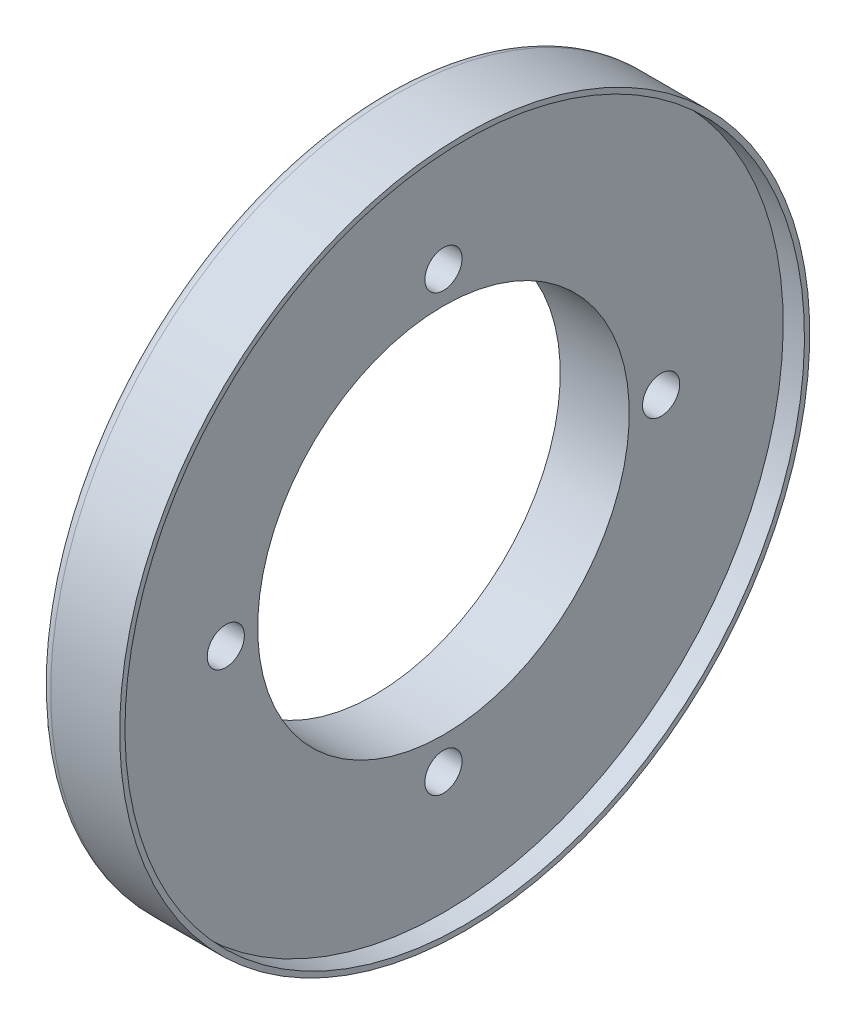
ISO-10303-21;
HEADER;
FILE_DESCRIPTION(('STEP AP214'),'2;1');
FILE_NAME('part.step','',(''),(''),'','','');
FILE_SCHEMA(('AUTOMOTIVE_DESIGN { 1 0 10303 214 1 1 1 1 }'));
ENDSEC;
DATA;
#1=APPLICATION_CONTEXT('core data for automotive mechanical design processes');
#2=APPLICATION_PROTOCOL_DEFINITION('international standard','automotive_design',2000,#1);
#3=PRODUCT_CONTEXT('',#1,'mechanical');
#4=PRODUCT('Part','Part','',(#3));
#5=PRODUCT_RELATED_PRODUCT_CATEGORY('part','',(#4));
#6=PRODUCT_DEFINITION_FORMATION('','',#4);
#7=PRODUCT_DEFINITION_CONTEXT('part definition',#1,'design');
#8=PRODUCT_DEFINITION('design','',#6,#7);
#9=PRODUCT_DEFINITION_SHAPE('','',#8);
#10=(LENGTH_UNIT() NAMED_UNIT(*) SI_UNIT(.MILLI.,.METRE.));
#11=(NAMED_UNIT(*) PLANE_ANGLE_UNIT() SI_UNIT($,.RADIAN.));
#12=(NAMED_UNIT(*) SI_UNIT($,.STERADIAN.) SOLID_ANGLE_UNIT());
#13=UNCERTAINTY_MEASURE_WITH_UNIT(LENGTH_MEASURE(1.E-05),#10,'distance_accuracy_value','');
#14=(GEOMETRIC_REPRESENTATION_CONTEXT(3) GLOBAL_UNCERTAINTY_ASSIGNED_CONTEXT((#13)) GLOBAL_UNIT_ASSIGNED_CONTEXT((#10,
#11,#12)) REPRESENTATION_CONTEXT('',''));
#15=CARTESIAN_POINT('',(0.,0.,0.));
#16=DIRECTION('',(0.,0.,1.));
#17=DIRECTION('',(1.,0.,0.));
#18=AXIS2_PLACEMENT_3D('',#15,#16,#17);
#19=CARTESIAN_POINT('',(-23.9525272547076,0.,0.));
#20=DIRECTION('',(-1.,0.,0.));
#21=DIRECTION('',(0.,-1.,0.));
#22=AXIS2_PLACEMENT_3D('',#19,#20,#21);
#23=CYLINDRICAL_SURFACE('',#22,47.);
#24=CARTESIAN_POINT('',(0.,0.,0.));
#25=DIRECTION('',(-1.,0.,0.));
#26=DIRECTION('',(0.,-1.,0.));
#27=AXIS2_PLACEMENT_3D('',#24,#25,#26);
#28=CIRCLE('',#27,47.);
#29=CARTESIAN_POINT('',(0.,-47.,0.));
#30=VERTEX_POINT('',#29);
#31=EDGE_CURVE('E62',#30,#30,#28,.T.);
#32=ORIENTED_EDGE('',*,*,#31,.F.);
#33=EDGE_LOOP('',(#32));
#34=FACE_BOUND('',#33,.T.);
#35=CARTESIAN_POINT('',(2.,0.,0.));
#36=DIRECTION('',(-1.,0.,0.));
#37=DIRECTION('',(0.,-1.,0.));
#38=AXIS2_PLACEMENT_3D('',#35,#36,#37);
#39=CIRCLE('',#38,47.);
#40=CARTESIAN_POINT('',(2.,-47.,0.));
#41=VERTEX_POINT('',#40);
#42=EDGE_CURVE('E10',#41,#41,#39,.T.);
#43=ORIENTED_EDGE('',*,*,#42,.T.);
#44=EDGE_LOOP('',(#43));
#45=FACE_BOUND('',#44,.T.);
#46=ADVANCED_FACE('F31',(#34,#45),#23,.T.);
#47=CARTESIAN_POINT('',(2.,47.,0.));
#48=DIRECTION('',(1.,0.,0.));
#49=DIRECTION('',(0.,1.,0.));
#50=AXIS2_PLACEMENT_3D('',#47,#48,#49);
#51=PLANE('',#50);
#52=ORIENTED_EDGE('',*,*,#42,.F.);
#53=EDGE_LOOP('',(#52));
#54=FACE_BOUND('',#53,.T.);
#55=CARTESIAN_POINT('',(2.,0.,0.));
#56=DIRECTION('',(-1.,0.,0.));
#57=DIRECTION('',(0.,-1.,0.));
#58=AXIS2_PLACEMENT_3D('',#55,#56,#57);
#59=CIRCLE('',#58,63.);
#60=CARTESIAN_POINT('',(2.,-63.,0.));
#61=VERTEX_POINT('',#60);
#62=EDGE_CURVE('E37',#61,#61,#59,.T.);
#63=ORIENTED_EDGE('',*,*,#62,.T.);
#64=EDGE_LOOP('',(#63));
#65=FACE_BOUND('',#64,.T.);
#66=ADVANCED_FACE('F128',(#54,#65),#51,.F.);
#67=CARTESIAN_POINT('',(4.,0.,0.));
#68=DIRECTION('',(-1.,0.,0.));
#69=DIRECTION('',(0.,-1.,0.));
#70=AXIS2_PLACEMENT_3D('',#67,#68,#69);
#71=TOROIDAL_SURFACE('',#70,63.,2.);
#72=ORIENTED_EDGE('',*,*,#62,.F.);
#73=EDGE_LOOP('',(#72));
#74=FACE_BOUND('',#73,.T.);
#75=CARTESIAN_POINT('',(4.,0.,0.));
#76=DIRECTION('',(-1.,0.,0.));
#77=DIRECTION('',(0.,-1.,0.));
#78=AXIS2_PLACEMENT_3D('',#75,#76,#77);
#79=CIRCLE('',#78,65.);
#80=CARTESIAN_POINT('',(4.,-65.,0.));
#81=VERTEX_POINT('',#80);
#82=EDGE_CURVE('E41',#81,#81,#79,.T.);
#83=ORIENTED_EDGE('',*,*,#82,.T.);
#84=EDGE_LOOP('',(#83));
#85=FACE_BOUND('',#84,.T.);
#86=ADVANCED_FACE('F132',(#74,#85),#71,.T.);
#87=CARTESIAN_POINT('',(-23.9525272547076,0.,0.));
#88=DIRECTION('',(-1.,0.,0.));
#89=DIRECTION('',(0.,-1.,0.));
#90=AXIS2_PLACEMENT_3D('',#87,#88,#89);
#91=CYLINDRICAL_SURFACE('',#90,65.);
#92=ORIENTED_EDGE('',*,*,#82,.F.);
#93=EDGE_LOOP('',(#92));
#94=FACE_BOUND('',#93,.T.);
#95=CARTESIAN_POINT('',(17.,0.,0.));
#96=DIRECTION('',(-1.,0.,0.));
#97=DIRECTION('',(0.,-1.,0.));
#98=AXIS2_PLACEMENT_3D('',#95,#96,#97);
#99=CIRCLE('',#98,65.);
#100=CARTESIAN_POINT('',(17.,-65.,0.));
#101=VERTEX_POINT('',#100);
#102=EDGE_CURVE('E45',#101,#101,#99,.T.);
#103=ORIENTED_EDGE('',*,*,#102,.T.);
#104=EDGE_LOOP('',(#103));
#105=FACE_BOUND('',#104,.T.);
#106=ADVANCED_FACE('F137',(#94,#105),#91,.T.);
#107=CARTESIAN_POINT('',(17.,65.,0.));
#108=DIRECTION('',(-1.,0.,0.));
#109=DIRECTION('',(0.,-1.,0.));
#110=AXIS2_PLACEMENT_3D('',#107,#108,#109);
#111=PLANE('',#110);
#112=ORIENTED_EDGE('',*,*,#102,.F.);
#113=EDGE_LOOP('',(#112));
#114=FACE_BOUND('',#113,.T.);
#115=CARTESIAN_POINT('',(17.,0.,0.));
#116=DIRECTION('',(-1.,0.,0.));
#117=DIRECTION('',(0.,-1.,0.));
#118=AXIS2_PLACEMENT_3D('',#115,#116,#117);
#119=CIRCLE('',#118,64.);
#120=CARTESIAN_POINT('',(17.,-64.,0.));
#121=VERTEX_POINT('',#120);
#122=EDGE_CURVE('E50',#121,#121,#119,.T.);
#123=ORIENTED_EDGE('',*,*,#122,.T.);
#124=EDGE_LOOP('',(#123));
#125=FACE_BOUND('',#124,.T.);
#126=ADVANCED_FACE('F143',(#114,#125),#111,.F.);
#127=CARTESIAN_POINT('',(-23.9525272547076,0.,0.));
#128=DIRECTION('',(-1.,0.,0.));
#129=DIRECTION('',(0.,-1.,0.));
#130=AXIS2_PLACEMENT_3D('',#127,#128,#129);
#131=CYLINDRICAL_SURFACE('',#130,64.);
#132=ORIENTED_EDGE('',*,*,#122,.F.);
#133=EDGE_LOOP('',(#132));
#134=FACE_BOUND('',#133,.T.);
#135=CARTESIAN_POINT('',(13.,0.,0.));
#136=DIRECTION('',(-1.,0.,0.));
#137=DIRECTION('',(0.,-1.,0.));
#138=AXIS2_PLACEMENT_3D('',#135,#136,#137);
#139=CIRCLE('',#138,64.);
#140=CARTESIAN_POINT('',(13.,-64.,0.));
#141=VERTEX_POINT('',#140);
#142=EDGE_CURVE('E53',#141,#141,#139,.T.);
#143=ORIENTED_EDGE('',*,*,#142,.T.);
#144=EDGE_LOOP('',(#143));
#145=FACE_BOUND('',#144,.T.);
#146=ADVANCED_FACE('F104',(#134,#145),#131,.F.);
#147=CARTESIAN_POINT('',(13.,64.,0.));
#148=DIRECTION('',(-1.,0.,0.));
#149=DIRECTION('',(0.,-1.,0.));
#150=AXIS2_PLACEMENT_3D('',#147,#148,#149);
#151=PLANE('',#150);
#152=CARTESIAN_POINT('',(13.,41.,-4.29452453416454E-13));
#153=DIRECTION('',(1.,0.,0.));
#154=DIRECTION('',(0.,1.,0.));
#155=AXIS2_PLACEMENT_3D('',#152,#153,#154);
#156=CIRCLE('',#155,3.5);
#157=CARTESIAN_POINT('',(13.,44.5,-4.29452453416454E-13));
#158=VERTEX_POINT('',#157);
#159=EDGE_CURVE('E84',#158,#158,#156,.T.);
#160=ORIENTED_EDGE('',*,*,#159,.F.);
#161=EDGE_LOOP('',(#160));
#162=FACE_BOUND('',#161,.T.);
#163=CARTESIAN_POINT('',(13.,-1.43252208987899E-13,41.));
#164=DIRECTION('',(1.,0.,0.));
#165=DIRECTION('',(0.,1.,0.));
#166=AXIS2_PLACEMENT_3D('',#163,#164,#165);
#167=CIRCLE('',#166,3.49999999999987);
#168=CARTESIAN_POINT('',(13.,3.49999999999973,41.));
#169=VERTEX_POINT('',#168);
#170=EDGE_CURVE('E78',#169,#169,#167,.T.);
#171=ORIENTED_EDGE('',*,*,#170,.F.);
#172=EDGE_LOOP('',(#171));
#173=FACE_BOUND('',#172,.T.);
#174=CARTESIAN_POINT('',(13.,-41.0000000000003,0.));
#175=DIRECTION('',(1.,0.,0.));
#176=DIRECTION('',(0.,1.,0.));
#177=AXIS2_PLACEMENT_3D('',#174,#175,#176);
#178=CIRCLE('',#177,3.49999999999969);
#179=CARTESIAN_POINT('',(13.,-37.5000000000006,0.));
#180=VERTEX_POINT('',#179);
#181=EDGE_CURVE('E72',#180,#180,#178,.T.);
#182=ORIENTED_EDGE('',*,*,#181,.F.);
#183=EDGE_LOOP('',(#182));
#184=FACE_BOUND('',#183,.T.);
#185=CARTESIAN_POINT('',(13.,-1.43252208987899E-13,-41.));
#186=DIRECTION('',(1.,0.,0.));
#187=DIRECTION('',(0.,1.,0.));
#188=AXIS2_PLACEMENT_3D('',#185,#186,#187);
#189=CIRCLE('',#188,3.50000000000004);
#190=CARTESIAN_POINT('',(13.,3.4999999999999,-41.));
#191=VERTEX_POINT('',#190);
#192=EDGE_CURVE('E66',#191,#191,#189,.T.);
#193=ORIENTED_EDGE('',*,*,#192,.F.);
#194=EDGE_LOOP('',(#193));
#195=FACE_BOUND('',#194,.T.);
#196=ORIENTED_EDGE('',*,*,#142,.F.);
#197=EDGE_LOOP('',(#196));
#198=FACE_BOUND('',#197,.T.);
#199=CARTESIAN_POINT('',(13.,0.,0.));
#200=DIRECTION('',(-1.,0.,0.));
#201=DIRECTION('',(0.,-1.,0.));
#202=AXIS2_PLACEMENT_3D('',#199,#200,#201);
#203=CIRCLE('',#202,35.);
#204=CARTESIAN_POINT('',(13.,-35.,0.));
#205=VERTEX_POINT('',#204);
#206=EDGE_CURVE('E56',#205,#205,#203,.T.);
#207=ORIENTED_EDGE('',*,*,#206,.T.);
#208=EDGE_LOOP('',(#207));
#209=FACE_BOUND('',#208,.T.);
#210=ADVANCED_FACE('F100',(#162,#173,#184,#195,#198,#209),#151,.F.);
#211=CARTESIAN_POINT('',(-23.9525272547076,0.,0.));
#212=DIRECTION('',(-1.,0.,0.));
#213=DIRECTION('',(0.,-1.,0.));
#214=AXIS2_PLACEMENT_3D('',#211,#212,#213);
#215=CYLINDRICAL_SURFACE('',#214,35.);
#216=ORIENTED_EDGE('',*,*,#206,.F.);
#217=EDGE_LOOP('',(#216));
#218=FACE_BOUND('',#217,.T.);
#219=CARTESIAN_POINT('',(0.,0.,0.));
#220=DIRECTION('',(-1.,0.,0.));
#221=DIRECTION('',(0.,-1.,0.));
#222=AXIS2_PLACEMENT_3D('',#219,#220,#221);
#223=CIRCLE('',#222,35.);
#224=CARTESIAN_POINT('',(0.,-35.,0.));
#225=VERTEX_POINT('',#224);
#226=EDGE_CURVE('E59',#225,#225,#223,.T.);
#227=ORIENTED_EDGE('',*,*,#226,.T.);
#228=EDGE_LOOP('',(#227));
#229=FACE_BOUND('',#228,.T.);
#230=ADVANCED_FACE('F103',(#218,#229),#215,.F.);
#231=CARTESIAN_POINT('',(0.,35.,0.));
#232=DIRECTION('',(1.,0.,0.));
#233=DIRECTION('',(0.,1.,0.));
#234=AXIS2_PLACEMENT_3D('',#231,#232,#233);
#235=PLANE('',#234);
#236=CARTESIAN_POINT('',(0.,41.,-4.29452453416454E-13));
#237=DIRECTION('',(1.,0.,0.));
#238=DIRECTION('',(0.,1.,0.));
#239=AXIS2_PLACEMENT_3D('',#236,#237,#238);
#240=CIRCLE('',#239,3.5);
#241=CARTESIAN_POINT('',(0.,44.5,-4.29452453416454E-13));
#242=VERTEX_POINT('',#241);
#243=EDGE_CURVE('E81',#242,#242,#240,.T.);
#244=ORIENTED_EDGE('',*,*,#243,.T.);
#245=EDGE_LOOP('',(#244));
#246=FACE_BOUND('',#245,.T.);
#247=CARTESIAN_POINT('',(0.,-1.43079881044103E-13,41.));
#248=DIRECTION('',(1.,0.,0.));
#249=DIRECTION('',(0.,1.,0.));
#250=AXIS2_PLACEMENT_3D('',#247,#248,#249);
#251=CIRCLE('',#250,3.49999999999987);
#252=CARTESIAN_POINT('',(0.,3.49999999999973,41.));
#253=VERTEX_POINT('',#252);
#254=EDGE_CURVE('E75',#253,#253,#251,.T.);
#255=ORIENTED_EDGE('',*,*,#254,.T.);
#256=EDGE_LOOP('',(#255));
#257=FACE_BOUND('',#256,.T.);
#258=CARTESIAN_POINT('',(0.,-41.0000000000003,0.));
#259=DIRECTION('',(1.,0.,0.));
#260=DIRECTION('',(0.,1.,0.));
#261=AXIS2_PLACEMENT_3D('',#258,#259,#260);
#262=CIRCLE('',#261,3.49999999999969);
#263=CARTESIAN_POINT('',(0.,-37.5000000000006,0.));
#264=VERTEX_POINT('',#263);
#265=EDGE_CURVE('E69',#264,#264,#262,.T.);
#266=ORIENTED_EDGE('',*,*,#265,.T.);
#267=EDGE_LOOP('',(#266));
#268=FACE_BOUND('',#267,.T.);
#269=CARTESIAN_POINT('',(0.,-1.43079881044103E-13,-41.));
#270=DIRECTION('',(1.,0.,0.));
#271=DIRECTION('',(0.,1.,0.));
#272=AXIS2_PLACEMENT_3D('',#269,#270,#271);
#273=CIRCLE('',#272,3.50000000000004);
#274=CARTESIAN_POINT('',(0.,3.4999999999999,-41.));
#275=VERTEX_POINT('',#274);
#276=EDGE_CURVE('E65',#275,#275,#273,.T.);
#277=ORIENTED_EDGE('',*,*,#276,.T.);
#278=EDGE_LOOP('',(#277));
#279=FACE_BOUND('',#278,.T.);
#280=ORIENTED_EDGE('',*,*,#226,.F.);
#281=EDGE_LOOP('',(#280));
#282=FACE_BOUND('',#281,.T.);
#283=ORIENTED_EDGE('',*,*,#31,.T.);
#284=EDGE_LOOP('',(#283));
#285=FACE_BOUND('',#284,.T.);
#286=ADVANCED_FACE('F90',(#246,#257,#268,#279,#282,#285),#235,.F.);
#287=CARTESIAN_POINT('',(0.,-1.43079881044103E-13,-41.));
#288=DIRECTION('',(1.,0.,0.));
#289=DIRECTION('',(0.,1.,0.));
#290=AXIS2_PLACEMENT_3D('',#287,#288,#289);
#291=CYLINDRICAL_SURFACE('',#290,3.50000000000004);
#292=CARTESIAN_POINT('',(0.,3.4999999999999,-41.));
#293=CARTESIAN_POINT('',(0.135416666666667,3.4999999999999,-41.));
#294=CARTESIAN_POINT('',(0.270833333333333,3.4999999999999,-41.));
#295=CARTESIAN_POINT('',(0.541666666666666,3.4999999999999,-41.));
#296=CARTESIAN_POINT('',(0.677083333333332,3.4999999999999,-41.));
#297=CARTESIAN_POINT('',(0.947916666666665,3.4999999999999,-41.));
#298=CARTESIAN_POINT('',(1.08333333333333,3.4999999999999,-41.));
#299=CARTESIAN_POINT('',(1.35416666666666,3.4999999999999,-41.));
#300=CARTESIAN_POINT('',(1.48958333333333,3.4999999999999,-41.));
#301=CARTESIAN_POINT('',(1.76041666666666,3.4999999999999,-41.));
#302=CARTESIAN_POINT('',(1.89583333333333,3.4999999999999,-41.));
#303=CARTESIAN_POINT('',(2.16666666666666,3.4999999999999,-41.));
#304=CARTESIAN_POINT('',(2.30208333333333,3.4999999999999,-41.));
#305=CARTESIAN_POINT('',(2.57291666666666,3.4999999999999,-41.));
#306=CARTESIAN_POINT('',(2.70833333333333,3.4999999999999,-41.));
#307=CARTESIAN_POINT('',(2.97916666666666,3.4999999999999,-41.));
#308=CARTESIAN_POINT('',(3.11458333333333,3.4999999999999,-41.));
#309=CARTESIAN_POINT('',(3.38541666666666,3.4999999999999,-41.));
#310=CARTESIAN_POINT('',(3.52083333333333,3.4999999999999,-41.));
#311=CARTESIAN_POINT('',(3.79166666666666,3.4999999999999,-41.));
#312=CARTESIAN_POINT('',(3.92708333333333,3.4999999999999,-41.));
#313=CARTESIAN_POINT('',(4.19791666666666,3.4999999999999,-41.));
#314=CARTESIAN_POINT('',(4.33333333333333,3.4999999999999,-41.));
#315=CARTESIAN_POINT('',(4.60416666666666,3.4999999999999,-41.));
#316=CARTESIAN_POINT('',(4.73958333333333,3.4999999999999,-41.));
#317=CARTESIAN_POINT('',(5.01041666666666,3.4999999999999,-41.));
#318=CARTESIAN_POINT('',(5.14583333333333,3.4999999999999,-41.));
#319=CARTESIAN_POINT('',(5.41666666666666,3.4999999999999,-41.));
#320=CARTESIAN_POINT('',(5.55208333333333,3.4999999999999,-41.));
#321=CARTESIAN_POINT('',(5.82291666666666,3.4999999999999,-41.));
#322=CARTESIAN_POINT('',(5.95833333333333,3.4999999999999,-41.));
#323=CARTESIAN_POINT('',(6.22916666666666,3.4999999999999,-41.));
#324=CARTESIAN_POINT('',(6.36458333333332,3.4999999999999,-41.));
#325=CARTESIAN_POINT('',(6.63541666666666,3.4999999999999,-41.));
#326=CARTESIAN_POINT('',(6.77083333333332,3.4999999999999,-41.));
#327=CARTESIAN_POINT('',(7.04166666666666,3.4999999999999,-41.));
#328=CARTESIAN_POINT('',(7.17708333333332,3.4999999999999,-41.));
#329=CARTESIAN_POINT('',(7.44791666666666,3.4999999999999,-41.));
#330=CARTESIAN_POINT('',(7.58333333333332,3.4999999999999,-41.));
#331=CARTESIAN_POINT('',(7.85416666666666,3.4999999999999,-41.));
#332=CARTESIAN_POINT('',(7.98958333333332,3.4999999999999,-41.));
#333=CARTESIAN_POINT('',(8.26041666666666,3.4999999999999,-41.));
#334=CARTESIAN_POINT('',(8.39583333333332,3.4999999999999,-41.));
#335=CARTESIAN_POINT('',(8.66666666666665,3.4999999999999,-41.));
#336=CARTESIAN_POINT('',(8.80208333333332,3.4999999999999,-41.));
#337=CARTESIAN_POINT('',(9.07291666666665,3.4999999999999,-41.));
#338=CARTESIAN_POINT('',(9.20833333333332,3.4999999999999,-41.));
#339=CARTESIAN_POINT('',(9.47916666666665,3.4999999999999,-41.));
#340=CARTESIAN_POINT('',(9.61458333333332,3.4999999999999,-41.));
#341=CARTESIAN_POINT('',(9.88541666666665,3.4999999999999,-41.));
#342=CARTESIAN_POINT('',(10.0208333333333,3.4999999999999,-41.));
#343=CARTESIAN_POINT('',(10.2916666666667,3.4999999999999,-41.));
#344=CARTESIAN_POINT('',(10.4270833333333,3.4999999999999,-41.));
#345=CARTESIAN_POINT('',(10.6979166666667,3.4999999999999,-41.));
#346=CARTESIAN_POINT('',(10.8333333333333,3.4999999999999,-41.));
#347=CARTESIAN_POINT('',(11.1041666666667,3.4999999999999,-41.));
#348=CARTESIAN_POINT('',(11.2395833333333,3.4999999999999,-41.));
#349=CARTESIAN_POINT('',(11.5104166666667,3.4999999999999,-41.));
#350=CARTESIAN_POINT('',(11.6458333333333,3.4999999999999,-41.));
#351=CARTESIAN_POINT('',(11.9166666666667,3.4999999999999,-41.));
#352=CARTESIAN_POINT('',(12.0520833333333,3.4999999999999,-41.));
#353=CARTESIAN_POINT('',(12.3229166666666,3.4999999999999,-41.));
#354=CARTESIAN_POINT('',(12.4583333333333,3.4999999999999,-41.));
#355=CARTESIAN_POINT('',(12.7291666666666,3.4999999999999,-41.));
#356=CARTESIAN_POINT('',(12.8645833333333,3.4999999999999,-41.));
#357=CARTESIAN_POINT('',(13.,3.4999999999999,-41.));
#358=B_SPLINE_CURVE_WITH_KNOTS('',3,(#292,#293,#294,#295,#296,#297,#298,#299,#300,#301,#302,
#303,#304,#305,#306,#307,#308,#309,#310,#311,#312,#313,#314,#315,#316,#317,#318,#319,#320,#321,
#322,#323,#324,#325,#326,#327,#328,#329,#330,#331,#332,#333,#334,#335,#336,#337,#338,#339,#340,
#341,#342,#343,#344,#345,#346,#347,#348,#349,#350,#351,#352,#353,#354,#355,#356,#357),
.UNSPECIFIED.,.F.,.F.,(4,2,2,2,2,2,2,2,2,2,2,2,2,2,2,2,2,2,2,2,2,2,2,2,2,2,2,2,2,2,2,2,4),(0.,
0.406249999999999,0.812499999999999,1.21875,1.625,2.03125,2.4375,2.84375,3.25,3.65624999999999,
4.06249999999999,4.46874999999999,4.87499999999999,5.28124999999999,5.68749999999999,
6.09374999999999,6.49999999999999,6.90624999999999,7.31249999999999,7.71874999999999,
8.12499999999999,8.53124999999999,8.93749999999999,9.34374999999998,9.74999999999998,10.15625,
10.5625,10.96875,11.375,11.78125,12.1875,12.59375,13.),.UNSPECIFIED.);
#359=EDGE_CURVE('BSEAM123',#275,#191,#358,.T.);
#360=ORIENTED_EDGE('',*,*,#276,.F.);
#361=ORIENTED_EDGE('',*,*,#192,.T.);
#362=ORIENTED_EDGE('',*,*,#359,.T.);
#363=ORIENTED_EDGE('',*,*,#359,.F.);
#364=EDGE_LOOP('',(#360,#362,#361,#363));
#365=FACE_BOUND('',#364,.T.);
#366=ADVANCED_FACE('F123',(#365),#291,.F.);
#367=CARTESIAN_POINT('',(0.,-41.0000000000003,0.));
#368=DIRECTION('',(1.,0.,0.));
#369=DIRECTION('',(0.,1.,0.));
#370=AXIS2_PLACEMENT_3D('',#367,#368,#369);
#371=CYLINDRICAL_SURFACE('',#370,3.49999999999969);
#372=CARTESIAN_POINT('',(0.,-37.5000000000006,0.));
#373=CARTESIAN_POINT('',(0.135416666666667,-37.5000000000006,0.));
#374=CARTESIAN_POINT('',(0.270833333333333,-37.5000000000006,0.));
#375=CARTESIAN_POINT('',(0.541666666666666,-37.5000000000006,0.));
#376=CARTESIAN_POINT('',(0.677083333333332,-37.5000000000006,0.));
#377=CARTESIAN_POINT('',(0.947916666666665,-37.5000000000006,0.));
#378=CARTESIAN_POINT('',(1.08333333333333,-37.5000000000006,0.));
#379=CARTESIAN_POINT('',(1.35416666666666,-37.5000000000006,0.));
#380=CARTESIAN_POINT('',(1.48958333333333,-37.5000000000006,0.));
#381=CARTESIAN_POINT('',(1.76041666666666,-37.5000000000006,0.));
#382=CARTESIAN_POINT('',(1.89583333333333,-37.5000000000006,0.));
#383=CARTESIAN_POINT('',(2.16666666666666,-37.5000000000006,0.));
#384=CARTESIAN_POINT('',(2.30208333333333,-37.5000000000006,0.));
#385=CARTESIAN_POINT('',(2.57291666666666,-37.5000000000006,0.));
#386=CARTESIAN_POINT('',(2.70833333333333,-37.5000000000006,0.));
#387=CARTESIAN_POINT('',(2.97916666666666,-37.5000000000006,0.));
#388=CARTESIAN_POINT('',(3.11458333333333,-37.5000000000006,0.));
#389=CARTESIAN_POINT('',(3.38541666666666,-37.5000000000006,0.));
#390=CARTESIAN_POINT('',(3.52083333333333,-37.5000000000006,0.));
#391=CARTESIAN_POINT('',(3.79166666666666,-37.5000000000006,0.));
#392=CARTESIAN_POINT('',(3.92708333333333,-37.5000000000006,0.));
#393=CARTESIAN_POINT('',(4.19791666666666,-37.5000000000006,0.));
#394=CARTESIAN_POINT('',(4.33333333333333,-37.5000000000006,0.));
#395=CARTESIAN_POINT('',(4.60416666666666,-37.5000000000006,0.));
#396=CARTESIAN_POINT('',(4.73958333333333,-37.5000000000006,0.));
#397=CARTESIAN_POINT('',(5.01041666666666,-37.5000000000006,0.));
#398=CARTESIAN_POINT('',(5.14583333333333,-37.5000000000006,0.));
#399=CARTESIAN_POINT('',(5.41666666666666,-37.5000000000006,0.));
#400=CARTESIAN_POINT('',(5.55208333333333,-37.5000000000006,0.));
#401=CARTESIAN_POINT('',(5.82291666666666,-37.5000000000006,0.));
#402=CARTESIAN_POINT('',(5.95833333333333,-37.5000000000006,0.));
#403=CARTESIAN_POINT('',(6.22916666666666,-37.5000000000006,0.));
#404=CARTESIAN_POINT('',(6.36458333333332,-37.5000000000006,0.));
#405=CARTESIAN_POINT('',(6.63541666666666,-37.5000000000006,0.));
#406=CARTESIAN_POINT('',(6.77083333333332,-37.5000000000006,0.));
#407=CARTESIAN_POINT('',(7.04166666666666,-37.5000000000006,0.));
#408=CARTESIAN_POINT('',(7.17708333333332,-37.5000000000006,0.));
#409=CARTESIAN_POINT('',(7.44791666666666,-37.5000000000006,0.));
#410=CARTESIAN_POINT('',(7.58333333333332,-37.5000000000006,0.));
#411=CARTESIAN_POINT('',(7.85416666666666,-37.5000000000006,0.));
#412=CARTESIAN_POINT('',(7.98958333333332,-37.5000000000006,0.));
#413=CARTESIAN_POINT('',(8.26041666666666,-37.5000000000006,0.));
#414=CARTESIAN_POINT('',(8.39583333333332,-37.5000000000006,0.));
#415=CARTESIAN_POINT('',(8.66666666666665,-37.5000000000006,0.));
#416=CARTESIAN_POINT('',(8.80208333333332,-37.5000000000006,0.));
#417=CARTESIAN_POINT('',(9.07291666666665,-37.5000000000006,0.));
#418=CARTESIAN_POINT('',(9.20833333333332,-37.5000000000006,0.));
#419=CARTESIAN_POINT('',(9.47916666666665,-37.5000000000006,0.));
#420=CARTESIAN_POINT('',(9.61458333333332,-37.5000000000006,0.));
#421=CARTESIAN_POINT('',(9.88541666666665,-37.5000000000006,0.));
#422=CARTESIAN_POINT('',(10.0208333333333,-37.5000000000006,0.));
#423=CARTESIAN_POINT('',(10.2916666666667,-37.5000000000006,0.));
#424=CARTESIAN_POINT('',(10.4270833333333,-37.5000000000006,0.));
#425=CARTESIAN_POINT('',(10.6979166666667,-37.5000000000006,0.));
#426=CARTESIAN_POINT('',(10.8333333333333,-37.5000000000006,0.));
#427=CARTESIAN_POINT('',(11.1041666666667,-37.5000000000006,0.));
#428=CARTESIAN_POINT('',(11.2395833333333,-37.5000000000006,0.));
#429=CARTESIAN_POINT('',(11.5104166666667,-37.5000000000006,0.));
#430=CARTESIAN_POINT('',(11.6458333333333,-37.5000000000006,0.));
#431=CARTESIAN_POINT('',(11.9166666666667,-37.5000000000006,0.));
#432=CARTESIAN_POINT('',(12.0520833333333,-37.5000000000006,0.));
#433=CARTESIAN_POINT('',(12.3229166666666,-37.5000000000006,0.));
#434=CARTESIAN_POINT('',(12.4583333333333,-37.5000000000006,0.));
#435=CARTESIAN_POINT('',(12.7291666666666,-37.5000000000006,0.));
#436=CARTESIAN_POINT('',(12.8645833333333,-37.5000000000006,0.));
#437=CARTESIAN_POINT('',(13.,-37.5000000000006,0.));
#438=B_SPLINE_CURVE_WITH_KNOTS('',3,(#372,#373,#374,#375,#376,#377,#378,#379,#380,#381,#382,
#383,#384,#385,#386,#387,#388,#389,#390,#391,#392,#393,#394,#395,#396,#397,#398,#399,#400,#401,
#402,#403,#404,#405,#406,#407,#408,#409,#410,#411,#412,#413,#414,#415,#416,#417,#418,#419,#420,
#421,#422,#423,#424,#425,#426,#427,#428,#429,#430,#431,#432,#433,#434,#435,#436,#437),
.UNSPECIFIED.,.F.,.F.,(4,2,2,2,2,2,2,2,2,2,2,2,2,2,2,2,2,2,2,2,2,2,2,2,2,2,2,2,2,2,2,2,4),(0.,
0.406249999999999,0.812499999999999,1.21875,1.625,2.03125,2.4375,2.84375,3.25,3.65624999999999,
4.06249999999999,4.46874999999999,4.87499999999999,5.28124999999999,5.68749999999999,
6.09374999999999,6.49999999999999,6.90624999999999,7.31249999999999,7.71874999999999,
8.12499999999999,8.53124999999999,8.93749999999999,9.34374999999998,9.74999999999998,10.15625,
10.5625,10.96875,11.375,11.78125,12.1875,12.59375,13.),.UNSPECIFIED.);
#439=EDGE_CURVE('BSEAM153',#264,#180,#438,.T.);
#440=ORIENTED_EDGE('',*,*,#265,.F.);
#441=ORIENTED_EDGE('',*,*,#181,.T.);
#442=ORIENTED_EDGE('',*,*,#439,.T.);
#443=ORIENTED_EDGE('',*,*,#439,.F.);
#444=EDGE_LOOP('',(#440,#442,#441,#443));
#445=FACE_BOUND('',#444,.T.);
#446=ADVANCED_FACE('F153',(#445),#371,.F.);
#447=CARTESIAN_POINT('',(0.,-1.43079881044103E-13,41.));
#448=DIRECTION('',(1.,0.,0.));
#449=DIRECTION('',(0.,1.,0.));
#450=AXIS2_PLACEMENT_3D('',#447,#448,#449);
#451=CYLINDRICAL_SURFACE('',#450,3.49999999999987);
#452=CARTESIAN_POINT('',(0.,3.49999999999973,41.));
#453=CARTESIAN_POINT('',(0.135416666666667,3.49999999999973,41.));
#454=CARTESIAN_POINT('',(0.270833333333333,3.49999999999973,41.));
#455=CARTESIAN_POINT('',(0.541666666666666,3.49999999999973,41.));
#456=CARTESIAN_POINT('',(0.677083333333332,3.49999999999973,41.));
#457=CARTESIAN_POINT('',(0.947916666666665,3.49999999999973,41.));
#458=CARTESIAN_POINT('',(1.08333333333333,3.49999999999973,41.));
#459=CARTESIAN_POINT('',(1.35416666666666,3.49999999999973,41.));
#460=CARTESIAN_POINT('',(1.48958333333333,3.49999999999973,41.));
#461=CARTESIAN_POINT('',(1.76041666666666,3.49999999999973,41.));
#462=CARTESIAN_POINT('',(1.89583333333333,3.49999999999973,41.));
#463=CARTESIAN_POINT('',(2.16666666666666,3.49999999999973,41.));
#464=CARTESIAN_POINT('',(2.30208333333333,3.49999999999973,41.));
#465=CARTESIAN_POINT('',(2.57291666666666,3.49999999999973,41.));
#466=CARTESIAN_POINT('',(2.70833333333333,3.49999999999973,41.));
#467=CARTESIAN_POINT('',(2.97916666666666,3.49999999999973,41.));
#468=CARTESIAN_POINT('',(3.11458333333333,3.49999999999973,41.));
#469=CARTESIAN_POINT('',(3.38541666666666,3.49999999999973,41.));
#470=CARTESIAN_POINT('',(3.52083333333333,3.49999999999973,41.));
#471=CARTESIAN_POINT('',(3.79166666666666,3.49999999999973,41.));
#472=CARTESIAN_POINT('',(3.92708333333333,3.49999999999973,41.));
#473=CARTESIAN_POINT('',(4.19791666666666,3.49999999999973,41.));
#474=CARTESIAN_POINT('',(4.33333333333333,3.49999999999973,41.));
#475=CARTESIAN_POINT('',(4.60416666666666,3.49999999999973,41.));
#476=CARTESIAN_POINT('',(4.73958333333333,3.49999999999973,41.));
#477=CARTESIAN_POINT('',(5.01041666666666,3.49999999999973,41.));
#478=CARTESIAN_POINT('',(5.14583333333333,3.49999999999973,41.));
#479=CARTESIAN_POINT('',(5.41666666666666,3.49999999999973,41.));
#480=CARTESIAN_POINT('',(5.55208333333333,3.49999999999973,41.));
#481=CARTESIAN_POINT('',(5.82291666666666,3.49999999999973,41.));
#482=CARTESIAN_POINT('',(5.95833333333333,3.49999999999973,41.));
#483=CARTESIAN_POINT('',(6.22916666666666,3.49999999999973,41.));
#484=CARTESIAN_POINT('',(6.36458333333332,3.49999999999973,41.));
#485=CARTESIAN_POINT('',(6.63541666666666,3.49999999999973,41.));
#486=CARTESIAN_POINT('',(6.77083333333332,3.49999999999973,41.));
#487=CARTESIAN_POINT('',(7.04166666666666,3.49999999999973,41.));
#488=CARTESIAN_POINT('',(7.17708333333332,3.49999999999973,41.));
#489=CARTESIAN_POINT('',(7.44791666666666,3.49999999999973,41.));
#490=CARTESIAN_POINT('',(7.58333333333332,3.49999999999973,41.));
#491=CARTESIAN_POINT('',(7.85416666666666,3.49999999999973,41.));
#492=CARTESIAN_POINT('',(7.98958333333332,3.49999999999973,41.));
#493=CARTESIAN_POINT('',(8.26041666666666,3.49999999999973,41.));
#494=CARTESIAN_POINT('',(8.39583333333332,3.49999999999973,41.));
#495=CARTESIAN_POINT('',(8.66666666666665,3.49999999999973,41.));
#496=CARTESIAN_POINT('',(8.80208333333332,3.49999999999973,41.));
#497=CARTESIAN_POINT('',(9.07291666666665,3.49999999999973,41.));
#498=CARTESIAN_POINT('',(9.20833333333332,3.49999999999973,41.));
#499=CARTESIAN_POINT('',(9.47916666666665,3.49999999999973,41.));
#500=CARTESIAN_POINT('',(9.61458333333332,3.49999999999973,41.));
#501=CARTESIAN_POINT('',(9.88541666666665,3.49999999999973,41.));
#502=CARTESIAN_POINT('',(10.0208333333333,3.49999999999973,41.));
#503=CARTESIAN_POINT('',(10.2916666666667,3.49999999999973,41.));
#504=CARTESIAN_POINT('',(10.4270833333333,3.49999999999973,41.));
#505=CARTESIAN_POINT('',(10.6979166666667,3.49999999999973,41.));
#506=CARTESIAN_POINT('',(10.8333333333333,3.49999999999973,41.));
#507=CARTESIAN_POINT('',(11.1041666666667,3.49999999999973,41.));
#508=CARTESIAN_POINT('',(11.2395833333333,3.49999999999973,41.));
#509=CARTESIAN_POINT('',(11.5104166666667,3.49999999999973,41.));
#510=CARTESIAN_POINT('',(11.6458333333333,3.49999999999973,41.));
#511=CARTESIAN_POINT('',(11.9166666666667,3.49999999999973,41.));
#512=CARTESIAN_POINT('',(12.0520833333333,3.49999999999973,41.));
#513=CARTESIAN_POINT('',(12.3229166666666,3.49999999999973,41.));
#514=CARTESIAN_POINT('',(12.4583333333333,3.49999999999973,41.));
#515=CARTESIAN_POINT('',(12.7291666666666,3.49999999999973,41.));
#516=CARTESIAN_POINT('',(12.8645833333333,3.49999999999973,41.));
#517=CARTESIAN_POINT('',(13.,3.49999999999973,41.));
#518=B_SPLINE_CURVE_WITH_KNOTS('',3,(#452,#453,#454,#455,#456,#457,#458,#459,#460,#461,#462,
#463,#464,#465,#466,#467,#468,#469,#470,#471,#472,#473,#474,#475,#476,#477,#478,#479,#480,#481,
#482,#483,#484,#485,#486,#487,#488,#489,#490,#491,#492,#493,#494,#495,#496,#497,#498,#499,#500,
#501,#502,#503,#504,#505,#506,#507,#508,#509,#510,#511,#512,#513,#514,#515,#516,#517),
.UNSPECIFIED.,.F.,.F.,(4,2,2,2,2,2,2,2,2,2,2,2,2,2,2,2,2,2,2,2,2,2,2,2,2,2,2,2,2,2,2,2,4),(0.,
0.406249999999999,0.812499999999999,1.21875,1.625,2.03125,2.4375,2.84375,3.25,3.65624999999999,
4.06249999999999,4.46874999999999,4.87499999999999,5.28124999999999,5.68749999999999,
6.09374999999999,6.49999999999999,6.90624999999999,7.31249999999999,7.71874999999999,
8.12499999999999,8.53124999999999,8.93749999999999,9.34374999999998,9.74999999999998,10.15625,
10.5625,10.96875,11.375,11.78125,12.1875,12.59375,13.),.UNSPECIFIED.);
#519=EDGE_CURVE('BSEAM96',#253,#169,#518,.T.);
#520=ORIENTED_EDGE('',*,*,#254,.F.);
#521=ORIENTED_EDGE('',*,*,#170,.T.);
#522=ORIENTED_EDGE('',*,*,#519,.T.);
#523=ORIENTED_EDGE('',*,*,#519,.F.);
#524=EDGE_LOOP('',(#520,#522,#521,#523));
#525=FACE_BOUND('',#524,.T.);
#526=ADVANCED_FACE('F96',(#525),#451,.F.);
#527=CARTESIAN_POINT('',(0.,41.,-4.29452453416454E-13));
#528=DIRECTION('',(1.,0.,0.));
#529=DIRECTION('',(0.,1.,0.));
#530=AXIS2_PLACEMENT_3D('',#527,#528,#529);
#531=CYLINDRICAL_SURFACE('',#530,3.5);
#532=CARTESIAN_POINT('',(0.,44.5,-4.29452453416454E-13));
#533=CARTESIAN_POINT('',(0.135416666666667,44.5,-4.29452453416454E-13));
#534=CARTESIAN_POINT('',(0.270833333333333,44.5,-4.29452453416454E-13));
#535=CARTESIAN_POINT('',(0.541666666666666,44.5,-4.29452453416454E-13));
#536=CARTESIAN_POINT('',(0.677083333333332,44.5,-4.29452453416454E-13));
#537=CARTESIAN_POINT('',(0.947916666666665,44.5,-4.29452453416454E-13));
#538=CARTESIAN_POINT('',(1.08333333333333,44.5,-4.29452453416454E-13));
#539=CARTESIAN_POINT('',(1.35416666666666,44.5,-4.29452453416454E-13));
#540=CARTESIAN_POINT('',(1.48958333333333,44.5,-4.29452453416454E-13));
#541=CARTESIAN_POINT('',(1.76041666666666,44.5,-4.29452453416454E-13));
#542=CARTESIAN_POINT('',(1.89583333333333,44.5,-4.29452453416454E-13));
#543=CARTESIAN_POINT('',(2.16666666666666,44.5,-4.29452453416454E-13));
#544=CARTESIAN_POINT('',(2.30208333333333,44.5,-4.29452453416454E-13));
#545=CARTESIAN_POINT('',(2.57291666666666,44.5,-4.29452453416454E-13));
#546=CARTESIAN_POINT('',(2.70833333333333,44.5,-4.29452453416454E-13));
#547=CARTESIAN_POINT('',(2.97916666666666,44.5,-4.29452453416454E-13));
#548=CARTESIAN_POINT('',(3.11458333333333,44.5,-4.29452453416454E-13));
#549=CARTESIAN_POINT('',(3.38541666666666,44.5,-4.29452453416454E-13));
#550=CARTESIAN_POINT('',(3.52083333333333,44.5,-4.29452453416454E-13));
#551=CARTESIAN_POINT('',(3.79166666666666,44.5,-4.29452453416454E-13));
#552=CARTESIAN_POINT('',(3.92708333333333,44.5,-4.29452453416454E-13));
#553=CARTESIAN_POINT('',(4.19791666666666,44.5,-4.29452453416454E-13));
#554=CARTESIAN_POINT('',(4.33333333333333,44.5,-4.29452453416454E-13));
#555=CARTESIAN_POINT('',(4.60416666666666,44.5,-4.29452453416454E-13));
#556=CARTESIAN_POINT('',(4.73958333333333,44.5,-4.29452453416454E-13));
#557=CARTESIAN_POINT('',(5.01041666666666,44.5,-4.29452453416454E-13));
#558=CARTESIAN_POINT('',(5.14583333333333,44.5,-4.29452453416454E-13));
#559=CARTESIAN_POINT('',(5.41666666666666,44.5,-4.29452453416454E-13));
#560=CARTESIAN_POINT('',(5.55208333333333,44.5,-4.29452453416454E-13));
#561=CARTESIAN_POINT('',(5.82291666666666,44.5,-4.29452453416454E-13));
#562=CARTESIAN_POINT('',(5.95833333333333,44.5,-4.29452453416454E-13));
#563=CARTESIAN_POINT('',(6.22916666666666,44.5,-4.29452453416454E-13));
#564=CARTESIAN_POINT('',(6.36458333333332,44.5,-4.29452453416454E-13));
#565=CARTESIAN_POINT('',(6.63541666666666,44.5,-4.29452453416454E-13));
#566=CARTESIAN_POINT('',(6.77083333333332,44.5,-4.29452453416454E-13));
#567=CARTESIAN_POINT('',(7.04166666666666,44.5,-4.29452453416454E-13));
#568=CARTESIAN_POINT('',(7.17708333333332,44.5,-4.29452453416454E-13));
#569=CARTESIAN_POINT('',(7.44791666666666,44.5,-4.29452453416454E-13));
#570=CARTESIAN_POINT('',(7.58333333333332,44.5,-4.29452453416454E-13));
#571=CARTESIAN_POINT('',(7.85416666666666,44.5,-4.29452453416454E-13));
#572=CARTESIAN_POINT('',(7.98958333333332,44.5,-4.29452453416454E-13));
#573=CARTESIAN_POINT('',(8.26041666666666,44.5,-4.29452453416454E-13));
#574=CARTESIAN_POINT('',(8.39583333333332,44.5,-4.29452453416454E-13));
#575=CARTESIAN_POINT('',(8.66666666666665,44.5,-4.29452453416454E-13));
#576=CARTESIAN_POINT('',(8.80208333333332,44.5,-4.29452453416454E-13));
#577=CARTESIAN_POINT('',(9.07291666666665,44.5,-4.29452453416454E-13));
#578=CARTESIAN_POINT('',(9.20833333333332,44.5,-4.29452453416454E-13));
#579=CARTESIAN_POINT('',(9.47916666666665,44.5,-4.29452453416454E-13));
#580=CARTESIAN_POINT('',(9.61458333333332,44.5,-4.29452453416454E-13));
#581=CARTESIAN_POINT('',(9.88541666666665,44.5,-4.29452453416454E-13));
#582=CARTESIAN_POINT('',(10.0208333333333,44.5,-4.29452453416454E-13));
#583=CARTESIAN_POINT('',(10.2916666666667,44.5,-4.29452453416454E-13));
#584=CARTESIAN_POINT('',(10.4270833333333,44.5,-4.29452453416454E-13));
#585=CARTESIAN_POINT('',(10.6979166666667,44.5,-4.29452453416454E-13));
#586=CARTESIAN_POINT('',(10.8333333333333,44.5,-4.29452453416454E-13));
#587=CARTESIAN_POINT('',(11.1041666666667,44.5,-4.29452453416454E-13));
#588=CARTESIAN_POINT('',(11.2395833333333,44.5,-4.29452453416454E-13));
#589=CARTESIAN_POINT('',(11.5104166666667,44.5,-4.29452453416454E-13));
#590=CARTESIAN_POINT('',(11.6458333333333,44.5,-4.29452453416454E-13));
#591=CARTESIAN_POINT('',(11.9166666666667,44.5,-4.29452453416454E-13));
#592=CARTESIAN_POINT('',(12.0520833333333,44.5,-4.29452453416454E-13));
#593=CARTESIAN_POINT('',(12.3229166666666,44.5,-4.29452453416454E-13));
#594=CARTESIAN_POINT('',(12.4583333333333,44.5,-4.29452453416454E-13));
#595=CARTESIAN_POINT('',(12.7291666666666,44.5,-4.29452453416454E-13));
#596=CARTESIAN_POINT('',(12.8645833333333,44.5,-4.29452453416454E-13));
#597=CARTESIAN_POINT('',(13.,44.5,-4.29452453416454E-13));
#598=B_SPLINE_CURVE_WITH_KNOTS('',3,(#532,#533,#534,#535,#536,#537,#538,#539,#540,#541,#542,
#543,#544,#545,#546,#547,#548,#549,#550,#551,#552,#553,#554,#555,#556,#557,#558,#559,#560,#561,
#562,#563,#564,#565,#566,#567,#568,#569,#570,#571,#572,#573,#574,#575,#576,#577,#578,#579,#580,
#581,#582,#583,#584,#585,#586,#587,#588,#589,#590,#591,#592,#593,#594,#595,#596,#597),
.UNSPECIFIED.,.F.,.F.,(4,2,2,2,2,2,2,2,2,2,2,2,2,2,2,2,2,2,2,2,2,2,2,2,2,2,2,2,2,2,2,2,4),(0.,
0.406249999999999,0.812499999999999,1.21875,1.625,2.03125,2.4375,2.84375,3.25,3.65624999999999,
4.06249999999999,4.46874999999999,4.87499999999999,5.28124999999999,5.68749999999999,
6.09374999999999,6.49999999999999,6.90624999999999,7.31249999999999,7.71874999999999,
8.12499999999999,8.53124999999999,8.93749999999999,9.34374999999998,9.74999999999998,10.15625,
10.5625,10.96875,11.375,11.78125,12.1875,12.59375,13.),.UNSPECIFIED.);
#599=EDGE_CURVE('BSEAM93',#242,#158,#598,.T.);
#600=ORIENTED_EDGE('',*,*,#243,.F.);
#601=ORIENTED_EDGE('',*,*,#159,.T.);
#602=ORIENTED_EDGE('',*,*,#599,.T.);
#603=ORIENTED_EDGE('',*,*,#599,.F.);
#604=EDGE_LOOP('',(#600,#602,#601,#603));
#605=FACE_BOUND('',#604,.T.);
#606=ADVANCED_FACE('F93',(#605),#531,.F.);
#607=CLOSED_SHELL('',(#46,#66,#86,#106,#126,#146,#210,#230,#286,#366,#446,#526,#606));
#608=MANIFOLD_SOLID_BREP('B2',#607);
#609=ADVANCED_BREP_SHAPE_REPRESENTATION('',(#18,#608),#14);
#610=SHAPE_DEFINITION_REPRESENTATION(#9,#609);
ENDSEC;
END-ISO-10303-21;
